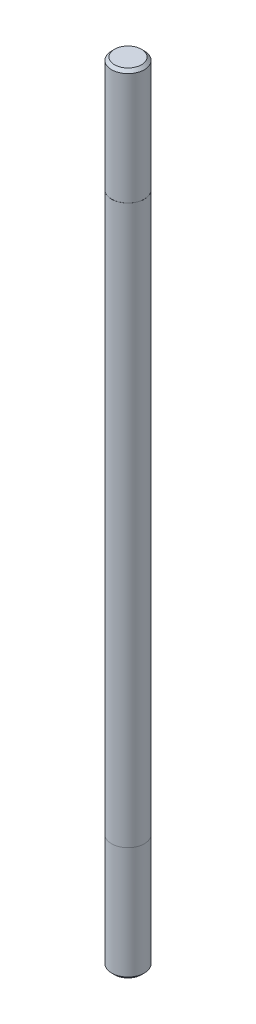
from build123d import *

# Parameters (mm, degrees)
SKETCH1_R      = 2
EXTRUDE1_DEPTH = 68
SKETCH2_R      = 1.99
EXTRUDE2_DEPTH = 14
EXTRUDE3_START = 14
SKETCH3_R      = 1.99
EXTRUDE3_DEPTH = 14
CHAMFER1_SIZE  = 0.35


with BuildPart() as part:
    # Sketch1 → Extrude1 (new body)
    with BuildSketch(Plane(origin=(0, 0, 0), x_dir=(1, 0, 0), z_dir=(0, 1, 0))):
        with Locations(Location((0, 0, 0), (0, 0, 270))):
            Circle(SKETCH1_R)
    extrude(amount=EXTRUDE1_DEPTH)

    # Sketch2 → Extrude2 (add)
    with BuildSketch(Plane(origin=(0, 68, 0), x_dir=(-1, 0, 0), z_dir=(0, 1, 0))):
        with Locations(Location((0, 0, 0), (0, 0, 90))):
            Circle(SKETCH2_R)
    extrude(amount=EXTRUDE2_DEPTH)

    # Sketch3 → Extrude3 (add)
    with BuildSketch(Plane.XZ.offset(EXTRUDE3_START)):
        with Locations(Location((0, 0, 0), (0, 0, 90))):
            Circle(SKETCH3_R)
    extrude(amount=-EXTRUDE3_DEPTH)

    # Chamfer1
    chamfer1_edges = [part.edges().sort_by_distance(p)[0] for p in [
        (0, -14, -1.99),
        (0, 82, -1.99),
    ]]
    chamfer(chamfer1_edges, length=CHAMFER1_SIZE)


solid = part.part
